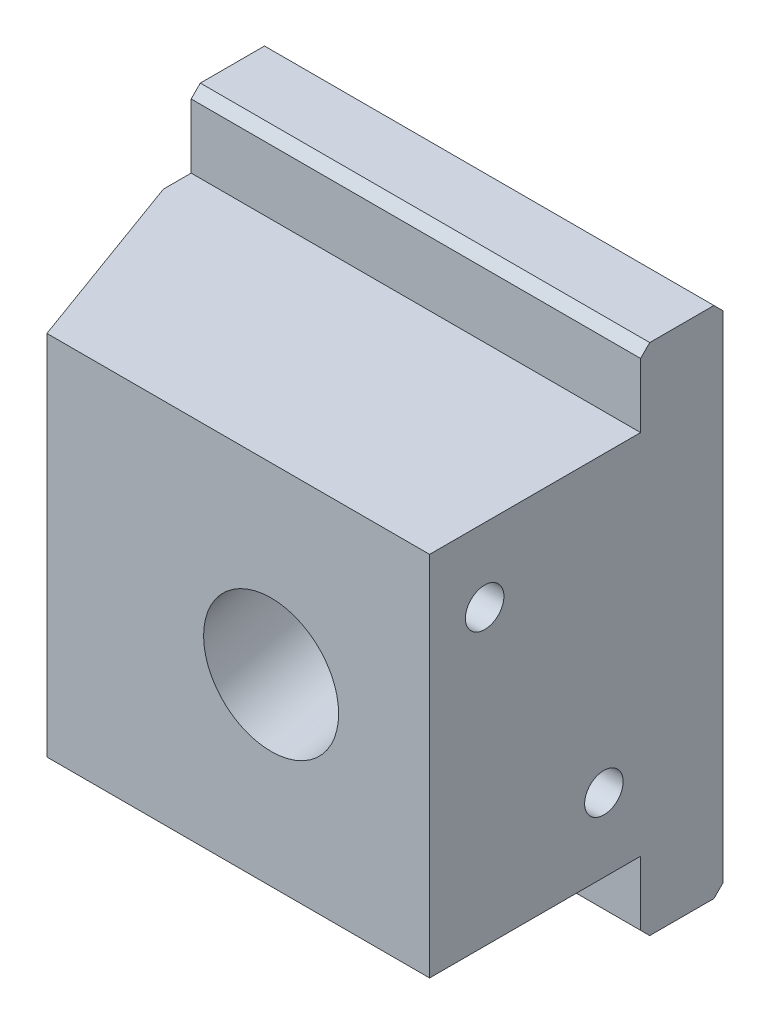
ISO-10303-21;
HEADER;
FILE_DESCRIPTION(('STEP AP214'),'2;1');
FILE_NAME('part.step','',(''),(''),'','','');
FILE_SCHEMA(('AUTOMOTIVE_DESIGN { 1 0 10303 214 1 1 1 1 }'));
ENDSEC;
DATA;
#1=APPLICATION_CONTEXT('core data for automotive mechanical design processes');
#2=APPLICATION_PROTOCOL_DEFINITION('international standard','automotive_design',2000,#1);
#3=PRODUCT_CONTEXT('',#1,'mechanical');
#4=PRODUCT('Part','Part','',(#3));
#5=PRODUCT_RELATED_PRODUCT_CATEGORY('part','',(#4));
#6=PRODUCT_DEFINITION_FORMATION('','',#4);
#7=PRODUCT_DEFINITION_CONTEXT('part definition',#1,'design');
#8=PRODUCT_DEFINITION('design','',#6,#7);
#9=PRODUCT_DEFINITION_SHAPE('','',#8);
#10=(LENGTH_UNIT() NAMED_UNIT(*) SI_UNIT(.MILLI.,.METRE.));
#11=(NAMED_UNIT(*) PLANE_ANGLE_UNIT() SI_UNIT($,.RADIAN.));
#12=(NAMED_UNIT(*) SI_UNIT($,.STERADIAN.) SOLID_ANGLE_UNIT());
#13=UNCERTAINTY_MEASURE_WITH_UNIT(LENGTH_MEASURE(1.E-05),#10,'distance_accuracy_value','');
#14=(GEOMETRIC_REPRESENTATION_CONTEXT(3) GLOBAL_UNCERTAINTY_ASSIGNED_CONTEXT((#13)) GLOBAL_UNIT_ASSIGNED_CONTEXT((#10,
#11,#12)) REPRESENTATION_CONTEXT('',''));
#15=CARTESIAN_POINT('',(0.,0.,0.));
#16=DIRECTION('',(0.,0.,1.));
#17=DIRECTION('',(1.,0.,0.));
#18=AXIS2_PLACEMENT_3D('',#15,#16,#17);
#19=CARTESIAN_POINT('',(-121.,-21.85,-40.));
#20=DIRECTION('',(1.,0.,0.));
#21=DIRECTION('',(0.,0.,-1.));
#22=AXIS2_PLACEMENT_3D('',#19,#20,#21);
#23=PLANE('',#22);
#24=CARTESIAN_POINT('',(-121.,-53.85,-21.));
#25=DIRECTION('',(1.,0.,0.));
#26=DIRECTION('',(0.,0.,-1.));
#27=AXIS2_PLACEMENT_3D('',#24,#25,#26);
#28=CIRCLE('',#27,2.1);
#29=CARTESIAN_POINT('',(-121.,-53.85,-23.1));
#30=VERTEX_POINT('',#29);
#31=EDGE_CURVE('E24',#30,#30,#28,.F.);
#32=ORIENTED_EDGE('',*,*,#31,.T.);
#33=EDGE_LOOP('',(#32));
#34=FACE_BOUND('',#33,.T.);
#35=DIRECTION('',(0.,0.,1.));
#36=VECTOR('',#35,1.);
#37=CARTESIAN_POINT('',(-121.,-69.85,-40.));
#38=LINE('',#37,#36);
#39=CARTESIAN_POINT('',(-121.,-69.85,-33.));
#40=VERTEX_POINT('',#39);
#41=CARTESIAN_POINT('',(-121.,-69.85,-26.));
#42=VERTEX_POINT('',#41);
#43=EDGE_CURVE('E129',#40,#42,#38,.T.);
#44=ORIENTED_EDGE('',*,*,#43,.F.);
#45=DIRECTION('',(0.,0.707106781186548,-0.707106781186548));
#46=VECTOR('',#45,1.);
#47=CARTESIAN_POINT('',(-121.,-42.35,-60.5));
#48=LINE('',#47,#46);
#49=CARTESIAN_POINT('',(-121.,-68.85,-34.));
#50=VERTEX_POINT('',#49);
#51=EDGE_CURVE('E80',#40,#50,#48,.T.);
#52=ORIENTED_EDGE('',*,*,#51,.T.);
#53=DIRECTION('',(0.,1.,0.));
#54=VECTOR('',#53,1.);
#55=CARTESIAN_POINT('',(-121.,-69.85,-34.));
#56=LINE('',#55,#54);
#57=CARTESIAN_POINT('',(-121.,-14.8500000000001,-34.));
#58=VERTEX_POINT('',#57);
#59=EDGE_CURVE('E205',#50,#58,#56,.T.);
#60=ORIENTED_EDGE('',*,*,#59,.T.);
#61=DIRECTION('',(0.,0.707106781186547,0.707106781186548));
#62=VECTOR('',#61,1.);
#63=CARTESIAN_POINT('',(-121.,-21.35,-40.5));
#64=LINE('',#63,#62);
#65=CARTESIAN_POINT('',(-121.,-13.8500000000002,-33.));
#66=VERTEX_POINT('',#65);
#67=EDGE_CURVE('E280',#58,#66,#64,.T.);
#68=ORIENTED_EDGE('',*,*,#67,.T.);
#69=DIRECTION('',(0.,0.,-1.));
#70=VECTOR('',#69,1.);
#71=CARTESIAN_POINT('',(-121.,-13.8500000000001,-25.));
#72=LINE('',#71,#70);
#73=CARTESIAN_POINT('',(-121.,-13.8500000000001,-26.));
#74=VERTEX_POINT('',#73);
#75=EDGE_CURVE('E120',#74,#66,#72,.T.);
#76=ORIENTED_EDGE('',*,*,#75,.F.);
#77=DIRECTION('',(0.,0.707106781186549,-0.707106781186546));
#78=VECTOR('',#77,1.);
#79=CARTESIAN_POINT('',(-121.,-10.8500000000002,-29.));
#80=LINE('',#79,#78);
#81=CARTESIAN_POINT('',(-121.,-14.8500000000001,-25.));
#82=VERTEX_POINT('',#81);
#83=EDGE_CURVE('E258',#74,#82,#80,.F.);
#84=ORIENTED_EDGE('',*,*,#83,.T.);
#85=DIRECTION('',(0.,1.,0.));
#86=VECTOR('',#85,1.);
#87=CARTESIAN_POINT('',(-121.,-21.85,-25.));
#88=LINE('',#87,#86);
#89=CARTESIAN_POINT('',(-121.,-21.85,-25.));
#90=VERTEX_POINT('',#89);
#91=EDGE_CURVE('E276',#90,#82,#88,.T.);
#92=ORIENTED_EDGE('',*,*,#91,.F.);
#93=DIRECTION('',(0.,0.,1.));
#94=VECTOR('',#93,1.);
#95=CARTESIAN_POINT('',(-121.,-21.85,-40.));
#96=LINE('',#95,#94);
#97=CARTESIAN_POINT('',(-121.,-21.85,-2.));
#98=VERTEX_POINT('',#97);
#99=EDGE_CURVE('E273',#90,#98,#96,.T.);
#100=ORIENTED_EDGE('',*,*,#99,.T.);
#101=DIRECTION('',(0.,-1.,0.));
#102=VECTOR('',#101,1.);
#103=CARTESIAN_POINT('',(-121.,-21.85,-2.));
#104=LINE('',#103,#102);
#105=CARTESIAN_POINT('',(-121.,-61.85,-2.));
#106=VERTEX_POINT('',#105);
#107=EDGE_CURVE('E270',#98,#106,#104,.T.);
#108=ORIENTED_EDGE('',*,*,#107,.T.);
#109=DIRECTION('',(0.,0.,-1.));
#110=VECTOR('',#109,1.);
#111=CARTESIAN_POINT('',(-121.,-61.85,-2.));
#112=LINE('',#111,#110);
#113=CARTESIAN_POINT('',(-121.,-61.85,-25.));
#114=VERTEX_POINT('',#113);
#115=EDGE_CURVE('E267',#106,#114,#112,.T.);
#116=ORIENTED_EDGE('',*,*,#115,.T.);
#117=DIRECTION('',(0.,1.,0.));
#118=VECTOR('',#117,1.);
#119=CARTESIAN_POINT('',(-121.,-69.85,-25.));
#120=LINE('',#119,#118);
#121=CARTESIAN_POINT('',(-121.,-68.85,-25.));
#122=VERTEX_POINT('',#121);
#123=EDGE_CURVE('E164',#122,#114,#120,.T.);
#124=ORIENTED_EDGE('',*,*,#123,.F.);
#125=DIRECTION('',(0.,0.707106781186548,0.707106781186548));
#126=VECTOR('',#125,1.);
#127=CARTESIAN_POINT('',(-121.,-52.85,-9.));
#128=LINE('',#127,#126);
#129=EDGE_CURVE('E251',#122,#42,#128,.F.);
#130=ORIENTED_EDGE('',*,*,#129,.T.);
#131=EDGE_LOOP('',(#44,#52,#60,#68,#76,#84,#92,#100,#108,#116,#124,#130));
#132=FACE_BOUND('',#131,.T.);
#133=CARTESIAN_POINT('',(-121.,-29.85,-8.));
#134=DIRECTION('',(1.,0.,0.));
#135=DIRECTION('',(0.,0.,-1.));
#136=AXIS2_PLACEMENT_3D('',#133,#134,#135);
#137=CIRCLE('',#136,2.1);
#138=CARTESIAN_POINT('',(-121.,-29.85,-10.1));
#139=VERTEX_POINT('',#138);
#140=EDGE_CURVE('E11',#139,#139,#137,.F.);
#141=ORIENTED_EDGE('',*,*,#140,.T.);
#142=EDGE_LOOP('',(#141));
#143=FACE_BOUND('',#142,.T.);
#144=ADVANCED_FACE('F16',(#34,#132,#143),#23,.T.);
#145=CARTESIAN_POINT('',(-170.,-21.85,-40.));
#146=DIRECTION('',(0.,1.,0.));
#147=DIRECTION('',(0.,0.,1.));
#148=AXIS2_PLACEMENT_3D('',#145,#146,#147);
#149=PLANE('',#148);
#150=DIRECTION('',(0.,0.,1.));
#151=VECTOR('',#150,1.);
#152=CARTESIAN_POINT('',(-170.,-21.85,-40.));
#153=LINE('',#152,#151);
#154=CARTESIAN_POINT('',(-170.,-21.85,-25.));
#155=VERTEX_POINT('',#154);
#156=CARTESIAN_POINT('',(-170.,-21.85,-21.979819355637));
#157=VERTEX_POINT('',#156);
#158=EDGE_CURVE('E149',#155,#157,#153,.T.);
#159=ORIENTED_EDGE('',*,*,#158,.T.);
#160=DIRECTION('',(0.342020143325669,0.,0.939692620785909));
#161=VECTOR('',#160,1.);
#162=CARTESIAN_POINT('',(-175.791574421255,-21.85,-37.8920393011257));
#163=LINE('',#162,#161);
#164=CARTESIAN_POINT('',(-162.727940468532,-21.85,-2.));
#165=VERTEX_POINT('',#164);
#166=EDGE_CURVE('E135',#157,#165,#163,.T.);
#167=ORIENTED_EDGE('',*,*,#166,.T.);
#168=DIRECTION('',(1.,0.,0.));
#169=VECTOR('',#168,1.);
#170=CARTESIAN_POINT('',(-170.,-21.85,-2.));
#171=LINE('',#170,#169);
#172=EDGE_CURVE('E157',#165,#98,#171,.T.);
#173=ORIENTED_EDGE('',*,*,#172,.T.);
#174=ORIENTED_EDGE('',*,*,#99,.F.);
#175=DIRECTION('',(-1.,0.,0.));
#176=VECTOR('',#175,1.);
#177=CARTESIAN_POINT('',(325.,-21.85,-25.));
#178=LINE('',#177,#176);
#179=EDGE_CURVE('E127',#90,#155,#178,.T.);
#180=ORIENTED_EDGE('',*,*,#179,.T.);
#181=EDGE_LOOP('',(#159,#167,#173,#174,#180));
#182=FACE_BOUND('',#181,.T.);
#183=ADVANCED_FACE('F308',(#182),#149,.T.);
#184=CARTESIAN_POINT('',(-170.,-21.85,-2.));
#185=DIRECTION('',(0.,0.,1.));
#186=DIRECTION('',(1.,0.,0.));
#187=AXIS2_PLACEMENT_3D('',#184,#185,#186);
#188=PLANE('',#187);
#189=DIRECTION('',(0.,-1.,0.));
#190=VECTOR('',#189,1.);
#191=CARTESIAN_POINT('',(-162.727940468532,-21.85,-2.));
#192=LINE('',#191,#190);
#193=CARTESIAN_POINT('',(-162.727940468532,-61.85,-2.));
#194=VERTEX_POINT('',#193);
#195=EDGE_CURVE('E182',#165,#194,#192,.T.);
#196=ORIENTED_EDGE('',*,*,#195,.T.);
#197=DIRECTION('',(1.,0.,0.));
#198=VECTOR('',#197,1.);
#199=CARTESIAN_POINT('',(-170.,-61.85,-2.));
#200=LINE('',#199,#198);
#201=EDGE_CURVE('E148',#194,#106,#200,.T.);
#202=ORIENTED_EDGE('',*,*,#201,.T.);
#203=ORIENTED_EDGE('',*,*,#107,.F.);
#204=ORIENTED_EDGE('',*,*,#172,.F.);
#205=EDGE_LOOP('',(#196,#202,#203,#204));
#206=FACE_BOUND('',#205,.T.);
#207=CARTESIAN_POINT('',(-138.280746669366,-41.85,-2.));
#208=DIRECTION('',(0.,0.,1.));
#209=DIRECTION('',(1.,0.,0.));
#210=AXIS2_PLACEMENT_3D('',#207,#208,#209);
#211=ELLIPSE('',#210,7.36184293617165,7.25);
#212=CARTESIAN_POINT('',(-130.918903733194,-41.85,-2.));
#213=VERTEX_POINT('',#212);
#214=EDGE_CURVE('E200',#213,#213,#211,.T.);
#215=ORIENTED_EDGE('',*,*,#214,.F.);
#216=EDGE_LOOP('',(#215));
#217=FACE_BOUND('',#216,.T.);
#218=ADVANCED_FACE('F312',(#206,#217),#188,.T.);
#219=CARTESIAN_POINT('',(-170.,-61.85,-2.));
#220=DIRECTION('',(0.,-1.,0.));
#221=DIRECTION('',(0.,0.,-1.));
#222=AXIS2_PLACEMENT_3D('',#219,#220,#221);
#223=PLANE('',#222);
#224=ORIENTED_EDGE('',*,*,#201,.F.);
#225=DIRECTION('',(-0.342020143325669,0.,-0.939692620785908));
#226=VECTOR('',#225,1.);
#227=CARTESIAN_POINT('',(-162.,-61.85,0.));
#228=LINE('',#227,#226);
#229=CARTESIAN_POINT('',(-170.,-61.85,-21.979819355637));
#230=VERTEX_POINT('',#229);
#231=EDGE_CURVE('E191',#194,#230,#228,.T.);
#232=ORIENTED_EDGE('',*,*,#231,.T.);
#233=DIRECTION('',(0.,0.,-1.));
#234=VECTOR('',#233,1.);
#235=CARTESIAN_POINT('',(-170.,-61.85,-2.));
#236=LINE('',#235,#234);
#237=CARTESIAN_POINT('',(-170.,-61.85,-25.));
#238=VERTEX_POINT('',#237);
#239=EDGE_CURVE('E144',#230,#238,#236,.T.);
#240=ORIENTED_EDGE('',*,*,#239,.T.);
#241=DIRECTION('',(-1.,0.,0.));
#242=VECTOR('',#241,1.);
#243=CARTESIAN_POINT('',(325.,-61.85,-25.));
#244=LINE('',#243,#242);
#245=EDGE_CURVE('E160',#114,#238,#244,.T.);
#246=ORIENTED_EDGE('',*,*,#245,.F.);
#247=ORIENTED_EDGE('',*,*,#115,.F.);
#248=EDGE_LOOP('',(#224,#232,#240,#246,#247));
#249=FACE_BOUND('',#248,.T.);
#250=ADVANCED_FACE('F318',(#249),#223,.T.);
#251=CARTESIAN_POINT('',(-170.,-21.85,-40.));
#252=DIRECTION('',(1.,0.,0.));
#253=DIRECTION('',(0.,0.,-1.));
#254=AXIS2_PLACEMENT_3D('',#251,#252,#253);
#255=PLANE('',#254);
#256=DIRECTION('',(0.,-1.,0.));
#257=VECTOR('',#256,1.);
#258=CARTESIAN_POINT('',(-170.,-13.8500000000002,-34.));
#259=LINE('',#258,#257);
#260=CARTESIAN_POINT('',(-170.,-14.8500000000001,-34.));
#261=VERTEX_POINT('',#260);
#262=CARTESIAN_POINT('',(-170.,-68.85,-34.));
#263=VERTEX_POINT('',#262);
#264=EDGE_CURVE('E203',#261,#263,#259,.T.);
#265=ORIENTED_EDGE('',*,*,#264,.T.);
#266=DIRECTION('',(0.,-0.707106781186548,0.707106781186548));
#267=VECTOR('',#266,1.);
#268=CARTESIAN_POINT('',(-170.,-69.85,-33.));
#269=LINE('',#268,#267);
#270=CARTESIAN_POINT('',(-170.,-69.85,-33.));
#271=VERTEX_POINT('',#270);
#272=EDGE_CURVE('E176',#263,#271,#269,.T.);
#273=ORIENTED_EDGE('',*,*,#272,.T.);
#274=DIRECTION('',(0.,0.,1.));
#275=VECTOR('',#274,1.);
#276=CARTESIAN_POINT('',(-170.,-69.85,-40.));
#277=LINE('',#276,#275);
#278=CARTESIAN_POINT('',(-170.,-69.85,-26.));
#279=VERTEX_POINT('',#278);
#280=EDGE_CURVE('E139',#271,#279,#277,.T.);
#281=ORIENTED_EDGE('',*,*,#280,.T.);
#282=DIRECTION('',(0.,-0.707106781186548,-0.707106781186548));
#283=VECTOR('',#282,1.);
#284=CARTESIAN_POINT('',(-170.,-69.85,-26.));
#285=LINE('',#284,#283);
#286=CARTESIAN_POINT('',(-170.,-68.85,-25.));
#287=VERTEX_POINT('',#286);
#288=EDGE_CURVE('E87',#279,#287,#285,.F.);
#289=ORIENTED_EDGE('',*,*,#288,.T.);
#290=DIRECTION('',(0.,1.,0.));
#291=VECTOR('',#290,1.);
#292=CARTESIAN_POINT('',(-170.,-69.85,-25.));
#293=LINE('',#292,#291);
#294=EDGE_CURVE('E163',#287,#238,#293,.T.);
#295=ORIENTED_EDGE('',*,*,#294,.T.);
#296=ORIENTED_EDGE('',*,*,#239,.F.);
#297=DIRECTION('',(0.,-1.,0.));
#298=VECTOR('',#297,1.);
#299=CARTESIAN_POINT('',(-170.,-9.04997250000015,-21.979819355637));
#300=LINE('',#299,#298);
#301=EDGE_CURVE('E185',#157,#230,#300,.T.);
#302=ORIENTED_EDGE('',*,*,#301,.F.);
#303=ORIENTED_EDGE('',*,*,#158,.F.);
#304=DIRECTION('',(0.,1.,0.));
#305=VECTOR('',#304,1.);
#306=CARTESIAN_POINT('',(-170.,-21.85,-25.));
#307=LINE('',#306,#305);
#308=CARTESIAN_POINT('',(-170.,-14.8500000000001,-25.));
#309=VERTEX_POINT('',#308);
#310=EDGE_CURVE('E126',#155,#309,#307,.T.);
#311=ORIENTED_EDGE('',*,*,#310,.T.);
#312=DIRECTION('',(0.,-0.707106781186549,0.707106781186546));
#313=VECTOR('',#312,1.);
#314=CARTESIAN_POINT('',(-170.,-14.8500000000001,-25.));
#315=LINE('',#314,#313);
#316=CARTESIAN_POINT('',(-170.,-13.8500000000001,-26.));
#317=VERTEX_POINT('',#316);
#318=EDGE_CURVE('E32',#309,#317,#315,.F.);
#319=ORIENTED_EDGE('',*,*,#318,.T.);
#320=DIRECTION('',(0.,0.,-1.));
#321=VECTOR('',#320,1.);
#322=CARTESIAN_POINT('',(-170.,-13.8500000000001,-25.));
#323=LINE('',#322,#321);
#324=CARTESIAN_POINT('',(-170.,-13.8500000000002,-33.));
#325=VERTEX_POINT('',#324);
#326=EDGE_CURVE('E118',#317,#325,#323,.T.);
#327=ORIENTED_EDGE('',*,*,#326,.T.);
#328=DIRECTION('',(0.,-0.707106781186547,-0.707106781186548));
#329=VECTOR('',#328,1.);
#330=CARTESIAN_POINT('',(-170.,-13.8500000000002,-33.));
#331=LINE('',#330,#329);
#332=EDGE_CURVE('E103',#325,#261,#331,.T.);
#333=ORIENTED_EDGE('',*,*,#332,.T.);
#334=EDGE_LOOP('',(#265,#273,#281,#289,#295,#296,#302,#303,#311,#319,#327,#333));
#335=FACE_BOUND('',#334,.T.);
#336=ADVANCED_FACE('F124',(#335),#255,.F.);
#337=CARTESIAN_POINT('',(325.,-69.85,-25.));
#338=DIRECTION('',(0.,0.,1.));
#339=DIRECTION('',(1.,0.,0.));
#340=AXIS2_PLACEMENT_3D('',#337,#338,#339);
#341=PLANE('',#340);
#342=ORIENTED_EDGE('',*,*,#294,.F.);
#343=DIRECTION('',(1.,0.,0.));
#344=VECTOR('',#343,1.);
#345=CARTESIAN_POINT('',(325.,-68.85,-25.));
#346=LINE('',#345,#344);
#347=EDGE_CURVE('E178',#287,#122,#346,.T.);
#348=ORIENTED_EDGE('',*,*,#347,.T.);
#349=ORIENTED_EDGE('',*,*,#123,.T.);
#350=ORIENTED_EDGE('',*,*,#245,.T.);
#351=EDGE_LOOP('',(#342,#348,#349,#350));
#352=FACE_BOUND('',#351,.T.);
#353=ADVANCED_FACE('F351',(#352),#341,.T.);
#354=CARTESIAN_POINT('',(325.,-69.85,-40.));
#355=DIRECTION('',(0.,-1.,0.));
#356=DIRECTION('',(0.,0.,-1.));
#357=AXIS2_PLACEMENT_3D('',#354,#355,#356);
#358=PLANE('',#357);
#359=ORIENTED_EDGE('',*,*,#280,.F.);
#360=DIRECTION('',(1.,0.,0.));
#361=VECTOR('',#360,1.);
#362=CARTESIAN_POINT('',(-120.,-69.85,-33.));
#363=LINE('',#362,#361);
#364=EDGE_CURVE('E250',#271,#40,#363,.T.);
#365=ORIENTED_EDGE('',*,*,#364,.T.);
#366=ORIENTED_EDGE('',*,*,#43,.T.);
#367=DIRECTION('',(-1.,0.,0.));
#368=VECTOR('',#367,1.);
#369=CARTESIAN_POINT('',(325.,-69.85,-26.));
#370=LINE('',#369,#368);
#371=EDGE_CURVE('E159',#42,#279,#370,.T.);
#372=ORIENTED_EDGE('',*,*,#371,.T.);
#373=EDGE_LOOP('',(#359,#365,#366,#372));
#374=FACE_BOUND('',#373,.T.);
#375=ADVANCED_FACE('F256',(#374),#358,.T.);
#376=CARTESIAN_POINT('',(325.,-21.85,-25.));
#377=DIRECTION('',(0.,0.,1.));
#378=DIRECTION('',(1.,0.,0.));
#379=AXIS2_PLACEMENT_3D('',#376,#377,#378);
#380=PLANE('',#379);
#381=ORIENTED_EDGE('',*,*,#91,.T.);
#382=DIRECTION('',(-1.,0.,0.));
#383=VECTOR('',#382,1.);
#384=CARTESIAN_POINT('',(325.,-14.8500000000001,-25.));
#385=LINE('',#384,#383);
#386=EDGE_CURVE('E121',#82,#309,#385,.T.);
#387=ORIENTED_EDGE('',*,*,#386,.T.);
#388=ORIENTED_EDGE('',*,*,#310,.F.);
#389=ORIENTED_EDGE('',*,*,#179,.F.);
#390=EDGE_LOOP('',(#381,#387,#388,#389));
#391=FACE_BOUND('',#390,.T.);
#392=ADVANCED_FACE('F337',(#391),#380,.T.);
#393=CARTESIAN_POINT('',(325.,-13.8500000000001,-25.));
#394=DIRECTION('',(0.,1.,0.));
#395=DIRECTION('',(0.,0.,1.));
#396=AXIS2_PLACEMENT_3D('',#393,#394,#395);
#397=PLANE('',#396);
#398=ORIENTED_EDGE('',*,*,#75,.T.);
#399=DIRECTION('',(-1.,0.,0.));
#400=VECTOR('',#399,1.);
#401=CARTESIAN_POINT('',(-170.,-13.8500000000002,-33.));
#402=LINE('',#401,#400);
#403=EDGE_CURVE('E107',#66,#325,#402,.T.);
#404=ORIENTED_EDGE('',*,*,#403,.T.);
#405=ORIENTED_EDGE('',*,*,#326,.F.);
#406=DIRECTION('',(1.,0.,0.));
#407=VECTOR('',#406,1.);
#408=CARTESIAN_POINT('',(325.,-13.8500000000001,-26.));
#409=LINE('',#408,#407);
#410=EDGE_CURVE('E122',#317,#74,#409,.T.);
#411=ORIENTED_EDGE('',*,*,#410,.T.);
#412=EDGE_LOOP('',(#398,#404,#405,#411));
#413=FACE_BOUND('',#412,.T.);
#414=ADVANCED_FACE('F117',(#413),#397,.T.);
#415=CARTESIAN_POINT('',(-162.,-9.04997250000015,0.));
#416=DIRECTION('',(-0.939692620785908,0.,0.342020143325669));
#417=DIRECTION('',(0.342020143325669,0.,0.939692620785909));
#418=AXIS2_PLACEMENT_3D('',#415,#416,#417);
#419=PLANE('',#418);
#420=ORIENTED_EDGE('',*,*,#231,.F.);
#421=ORIENTED_EDGE('',*,*,#195,.F.);
#422=ORIENTED_EDGE('',*,*,#166,.F.);
#423=ORIENTED_EDGE('',*,*,#301,.T.);
#424=EDGE_LOOP('',(#420,#421,#422,#423));
#425=FACE_BOUND('',#424,.T.);
#426=ADVANCED_FACE('F405',(#425),#419,.T.);
#427=CARTESIAN_POINT('',(-132.,-29.85,-8.));
#428=DIRECTION('',(1.,0.,0.));
#429=DIRECTION('',(0.,0.,-1.));
#430=AXIS2_PLACEMENT_3D('',#427,#428,#429);
#431=CONICAL_SURFACE('',#430,2.1,1.02974425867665);
#432=CARTESIAN_POINT('',(-132.,-29.85,-8.));
#433=DIRECTION('',(-1.,0.,0.));
#434=DIRECTION('',(0.,0.,1.));
#435=AXIS2_PLACEMENT_3D('',#432,#433,#434);
#436=CIRCLE('',#435,2.1);
#437=CARTESIAN_POINT('',(-132.,-29.85,-5.9));
#438=VERTEX_POINT('',#437);
#439=EDGE_CURVE('E194',#438,#438,#436,.T.);
#440=ORIENTED_EDGE('',*,*,#439,.F.);
#441=EDGE_LOOP('',(#440));
#442=FACE_BOUND('',#441,.T.);
#443=CARTESIAN_POINT('',(-133.261807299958,-29.85,-8.));
#444=VERTEX_POINT('',#443);
#445=VERTEX_LOOP('',#444);
#446=FACE_BOUND('',#445,.T.);
#447=ADVANCED_FACE('F303',(#442,#446),#431,.F.);
#448=CARTESIAN_POINT('',(-120.,-29.85,-8.));
#449=DIRECTION('',(-1.,0.,0.));
#450=DIRECTION('',(0.,0.,1.));
#451=AXIS2_PLACEMENT_3D('',#448,#449,#450);
#452=CYLINDRICAL_SURFACE('',#451,2.1);
#453=ORIENTED_EDGE('',*,*,#140,.F.);
#454=EDGE_LOOP('',(#453));
#455=FACE_BOUND('',#454,.T.);
#456=ORIENTED_EDGE('',*,*,#439,.T.);
#457=EDGE_LOOP('',(#456));
#458=FACE_BOUND('',#457,.T.);
#459=ADVANCED_FACE('F297',(#455,#458),#452,.F.);
#460=CARTESIAN_POINT('',(-132.,-53.85,-21.));
#461=DIRECTION('',(1.,0.,0.));
#462=DIRECTION('',(0.,0.,-1.));
#463=AXIS2_PLACEMENT_3D('',#460,#461,#462);
#464=CONICAL_SURFACE('',#463,2.1,1.02974425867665);
#465=CARTESIAN_POINT('',(-132.,-53.85,-21.));
#466=DIRECTION('',(-1.,0.,0.));
#467=DIRECTION('',(0.,0.,1.));
#468=AXIS2_PLACEMENT_3D('',#465,#466,#467);
#469=CIRCLE('',#468,2.1);
#470=CARTESIAN_POINT('',(-132.,-53.85,-18.9));
#471=VERTEX_POINT('',#470);
#472=EDGE_CURVE('E197',#471,#471,#469,.T.);
#473=ORIENTED_EDGE('',*,*,#472,.F.);
#474=EDGE_LOOP('',(#473));
#475=FACE_BOUND('',#474,.T.);
#476=CARTESIAN_POINT('',(-133.261807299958,-53.85,-21.));
#477=VERTEX_POINT('',#476);
#478=VERTEX_LOOP('',#477);
#479=FACE_BOUND('',#478,.T.);
#480=ADVANCED_FACE('F291',(#475,#479),#464,.F.);
#481=CARTESIAN_POINT('',(-120.,-53.85,-21.));
#482=DIRECTION('',(-1.,0.,0.));
#483=DIRECTION('',(0.,0.,1.));
#484=AXIS2_PLACEMENT_3D('',#481,#482,#483);
#485=CYLINDRICAL_SURFACE('',#484,2.1);
#486=ORIENTED_EDGE('',*,*,#31,.F.);
#487=EDGE_LOOP('',(#486));
#488=FACE_BOUND('',#487,.T.);
#489=ORIENTED_EDGE('',*,*,#472,.T.);
#490=EDGE_LOOP('',(#489));
#491=FACE_BOUND('',#490,.T.);
#492=ADVANCED_FACE('F287',(#488,#491),#485,.F.);
#493=CARTESIAN_POINT('',(-146.716830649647,-41.85,-49.8434097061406));
#494=DIRECTION('',(0.17364817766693,0.,0.984807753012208));
#495=DIRECTION('',(0.984807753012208,0.,-0.17364817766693));
#496=AXIS2_PLACEMENT_3D('',#493,#494,#495);
#497=CYLINDRICAL_SURFACE('',#496,7.25);
#498=CARTESIAN_POINT('',(-143.923210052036,-41.85,-34.));
#499=DIRECTION('',(0.,0.,1.));
#500=DIRECTION('',(1.,0.,0.));
#501=AXIS2_PLACEMENT_3D('',#498,#499,#500);
#502=ELLIPSE('',#501,7.36184293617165,7.25);
#503=CARTESIAN_POINT('',(-136.561367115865,-41.85,-34.));
#504=VERTEX_POINT('',#503);
#505=EDGE_CURVE('E150',#504,#504,#502,.F.);
#506=ORIENTED_EDGE('',*,*,#505,.T.);
#507=EDGE_LOOP('',(#506));
#508=FACE_BOUND('',#507,.T.);
#509=ORIENTED_EDGE('',*,*,#214,.T.);
#510=EDGE_LOOP('',(#509));
#511=FACE_BOUND('',#510,.T.);
#512=ADVANCED_FACE('F290',(#508,#511),#497,.F.);
#513=CARTESIAN_POINT('',(-170.,-13.8500000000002,-34.));
#514=DIRECTION('',(0.,0.,1.));
#515=DIRECTION('',(0.,-1.,0.));
#516=AXIS2_PLACEMENT_3D('',#513,#514,#515);
#517=PLANE('',#516);
#518=CARTESIAN_POINT('',(-162.,-41.85,-34.));
#519=DIRECTION('',(0.,0.,1.));
#520=DIRECTION('',(0.,-1.,0.));
#521=AXIS2_PLACEMENT_3D('',#518,#519,#520);
#522=CIRCLE('',#521,4.);
#523=CARTESIAN_POINT('',(-162.,-45.85,-34.));
#524=VERTEX_POINT('',#523);
#525=EDGE_CURVE('E207',#524,#524,#522,.T.);
#526=ORIENTED_EDGE('',*,*,#525,.T.);
#527=EDGE_LOOP('',(#526));
#528=FACE_BOUND('',#527,.T.);
#529=ORIENTED_EDGE('',*,*,#59,.F.);
#530=DIRECTION('',(-1.,0.,0.));
#531=VECTOR('',#530,1.);
#532=CARTESIAN_POINT('',(-170.,-68.85,-34.));
#533=LINE('',#532,#531);
#534=EDGE_CURVE('E172',#50,#263,#533,.T.);
#535=ORIENTED_EDGE('',*,*,#534,.T.);
#536=ORIENTED_EDGE('',*,*,#264,.F.);
#537=DIRECTION('',(1.,0.,0.));
#538=VECTOR('',#537,1.);
#539=CARTESIAN_POINT('',(-120.,-14.8500000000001,-34.));
#540=LINE('',#539,#538);
#541=EDGE_CURVE('E108',#261,#58,#540,.T.);
#542=ORIENTED_EDGE('',*,*,#541,.T.);
#543=EDGE_LOOP('',(#529,#535,#536,#542));
#544=FACE_BOUND('',#543,.T.);
#545=ORIENTED_EDGE('',*,*,#505,.F.);
#546=EDGE_LOOP('',(#545));
#547=FACE_BOUND('',#546,.T.);
#548=ADVANCED_FACE('F327',(#528,#544,#547),#517,.F.);
#549=CARTESIAN_POINT('',(325.,-69.85,-33.));
#550=DIRECTION('',(0.,-0.707106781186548,-0.707106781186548));
#551=DIRECTION('',(0.,0.707106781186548,-0.707106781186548));
#552=AXIS2_PLACEMENT_3D('',#549,#550,#551);
#553=PLANE('',#552);
#554=ORIENTED_EDGE('',*,*,#272,.F.);
#555=ORIENTED_EDGE('',*,*,#534,.F.);
#556=ORIENTED_EDGE('',*,*,#51,.F.);
#557=ORIENTED_EDGE('',*,*,#364,.F.);
#558=EDGE_LOOP('',(#554,#555,#556,#557));
#559=FACE_BOUND('',#558,.T.);
#560=ADVANCED_FACE('F249',(#559),#553,.T.);
#561=CARTESIAN_POINT('',(325.,-69.85,-26.));
#562=DIRECTION('',(0.,0.707106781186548,-0.707106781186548));
#563=DIRECTION('',(0.,0.707106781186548,0.707106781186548));
#564=AXIS2_PLACEMENT_3D('',#561,#562,#563);
#565=PLANE('',#564);
#566=ORIENTED_EDGE('',*,*,#129,.F.);
#567=ORIENTED_EDGE('',*,*,#347,.F.);
#568=ORIENTED_EDGE('',*,*,#288,.F.);
#569=ORIENTED_EDGE('',*,*,#371,.F.);
#570=EDGE_LOOP('',(#566,#567,#568,#569));
#571=FACE_BOUND('',#570,.T.);
#572=ADVANCED_FACE('F326',(#571),#565,.F.);
#573=CARTESIAN_POINT('',(325.,-13.8500000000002,-33.));
#574=DIRECTION('',(0.,0.707106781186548,-0.707106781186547));
#575=DIRECTION('',(0.,0.707106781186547,0.707106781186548));
#576=AXIS2_PLACEMENT_3D('',#573,#574,#575);
#577=PLANE('',#576);
#578=ORIENTED_EDGE('',*,*,#67,.F.);
#579=ORIENTED_EDGE('',*,*,#541,.F.);
#580=ORIENTED_EDGE('',*,*,#332,.F.);
#581=ORIENTED_EDGE('',*,*,#403,.F.);
#582=EDGE_LOOP('',(#578,#579,#580,#581));
#583=FACE_BOUND('',#582,.T.);
#584=ADVANCED_FACE('F106',(#583),#577,.T.);
#585=CARTESIAN_POINT('',(325.,-14.8500000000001,-25.));
#586=DIRECTION('',(0.,-0.707106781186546,-0.707106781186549));
#587=DIRECTION('',(0.,0.707106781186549,-0.707106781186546));
#588=AXIS2_PLACEMENT_3D('',#585,#586,#587);
#589=PLANE('',#588);
#590=ORIENTED_EDGE('',*,*,#83,.F.);
#591=ORIENTED_EDGE('',*,*,#410,.F.);
#592=ORIENTED_EDGE('',*,*,#318,.F.);
#593=ORIENTED_EDGE('',*,*,#386,.F.);
#594=EDGE_LOOP('',(#590,#591,#592,#593));
#595=FACE_BOUND('',#594,.T.);
#596=ADVANCED_FACE('F219',(#595),#589,.F.);
#597=CARTESIAN_POINT('',(-162.,-41.85,-33.));
#598=DIRECTION('',(0.,0.,-1.));
#599=DIRECTION('',(0.,1.,0.));
#600=AXIS2_PLACEMENT_3D('',#597,#598,#599);
#601=CONICAL_SURFACE('',#600,4.,1.02974425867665);
#602=CARTESIAN_POINT('',(-162.,-41.85,-33.));
#603=DIRECTION('',(0.,0.,1.));
#604=DIRECTION('',(0.,-1.,0.));
#605=AXIS2_PLACEMENT_3D('',#602,#603,#604);
#606=CIRCLE('',#605,4.);
#607=CARTESIAN_POINT('',(-162.,-45.85,-33.));
#608=VERTEX_POINT('',#607);
#609=EDGE_CURVE('E206',#608,#608,#606,.T.);
#610=ORIENTED_EDGE('',*,*,#609,.F.);
#611=EDGE_LOOP('',(#610));
#612=FACE_BOUND('',#611,.T.);
#613=CARTESIAN_POINT('',(-162.,-41.85,-30.5965575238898));
#614=VERTEX_POINT('',#613);
#615=VERTEX_LOOP('',#614);
#616=FACE_BOUND('',#615,.T.);
#617=ADVANCED_FACE('F216',(#612,#616),#601,.F.);
#618=CARTESIAN_POINT('',(-162.,-41.85,-34.));
#619=DIRECTION('',(0.,0.,1.));
#620=DIRECTION('',(0.,-1.,0.));
#621=AXIS2_PLACEMENT_3D('',#618,#619,#620);
#622=CYLINDRICAL_SURFACE('',#621,4.);
#623=ORIENTED_EDGE('',*,*,#609,.T.);
#624=EDGE_LOOP('',(#623));
#625=FACE_BOUND('',#624,.T.);
#626=ORIENTED_EDGE('',*,*,#525,.F.);
#627=EDGE_LOOP('',(#626));
#628=FACE_BOUND('',#627,.T.);
#629=ADVANCED_FACE('F213',(#625,#628),#622,.F.);
#630=CLOSED_SHELL('',(#144,#183,#218,#250,#336,#353,#375,#392,#414,#426,#447,#459,#480,#492,
#512,#548,#560,#572,#584,#596,#617,#629));
#631=MANIFOLD_SOLID_BREP('B1',#630);
#632=ADVANCED_BREP_SHAPE_REPRESENTATION('',(#18,#631),#14);
#633=SHAPE_DEFINITION_REPRESENTATION(#9,#632);
ENDSEC;
END-ISO-10303-21;
